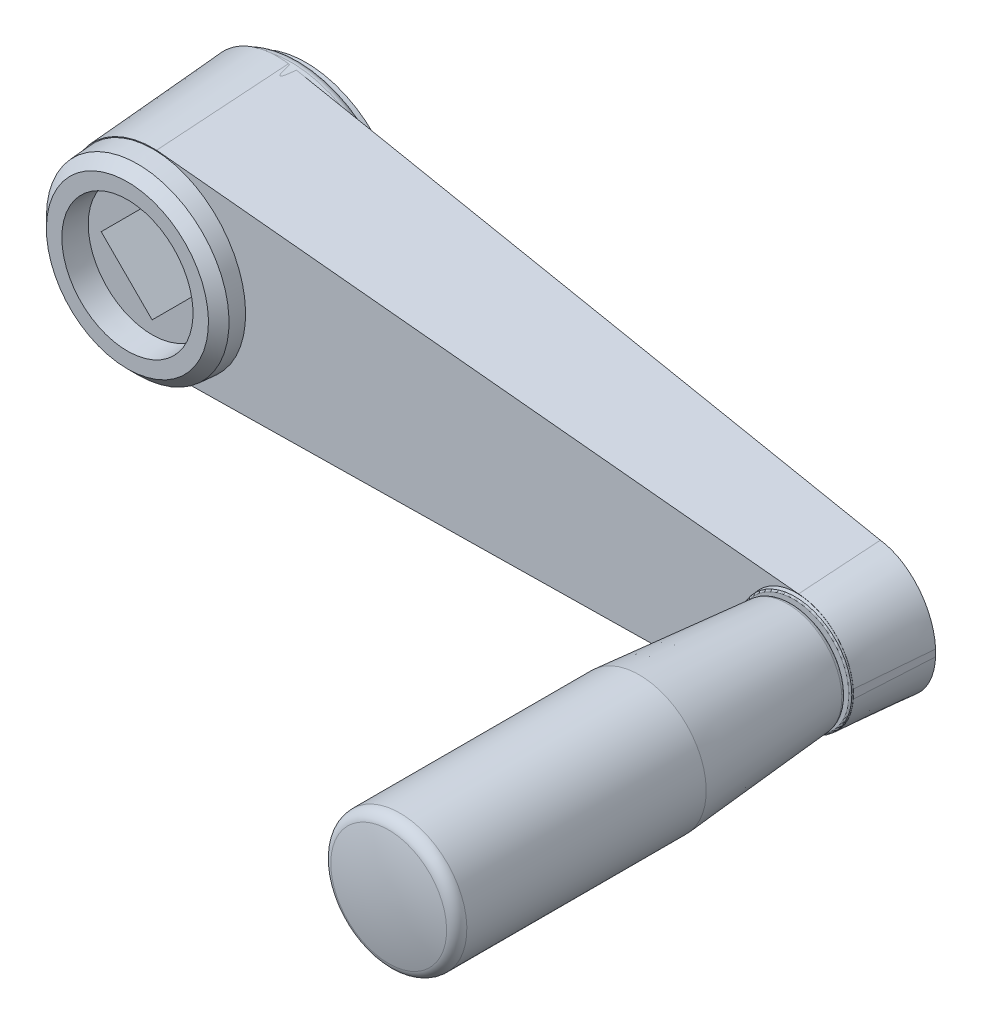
ISO-10303-21;
HEADER;
FILE_DESCRIPTION(('STEP AP214'),'2;1');
FILE_NAME('part.step','',(''),(''),'','','');
FILE_SCHEMA(('AUTOMOTIVE_DESIGN { 1 0 10303 214 1 1 1 1 }'));
ENDSEC;
DATA;
#1=APPLICATION_CONTEXT('core data for automotive mechanical design processes');
#2=APPLICATION_PROTOCOL_DEFINITION('international standard','automotive_design',2000,#1);
#3=PRODUCT_CONTEXT('',#1,'mechanical');
#4=PRODUCT('Part','Part','',(#3));
#5=PRODUCT_RELATED_PRODUCT_CATEGORY('part','',(#4));
#6=PRODUCT_DEFINITION_FORMATION('','',#4);
#7=PRODUCT_DEFINITION_CONTEXT('part definition',#1,'design');
#8=PRODUCT_DEFINITION('design','',#6,#7);
#9=PRODUCT_DEFINITION_SHAPE('','',#8);
#10=(LENGTH_UNIT() NAMED_UNIT(*) SI_UNIT(.MILLI.,.METRE.));
#11=(NAMED_UNIT(*) PLANE_ANGLE_UNIT() SI_UNIT($,.RADIAN.));
#12=(NAMED_UNIT(*) SI_UNIT($,.STERADIAN.) SOLID_ANGLE_UNIT());
#13=UNCERTAINTY_MEASURE_WITH_UNIT(LENGTH_MEASURE(1.E-05),#10,'distance_accuracy_value','');
#14=(GEOMETRIC_REPRESENTATION_CONTEXT(3) GLOBAL_UNCERTAINTY_ASSIGNED_CONTEXT((#13)) GLOBAL_UNIT_ASSIGNED_CONTEXT((#10,
#11,#12)) REPRESENTATION_CONTEXT('',''));
#15=CARTESIAN_POINT('',(0.,0.,0.));
#16=DIRECTION('',(0.,0.,1.));
#17=DIRECTION('',(1.,0.,0.));
#18=AXIS2_PLACEMENT_3D('',#15,#16,#17);
#19=CARTESIAN_POINT('',(0.,0.,35.));
#20=DIRECTION('',(0.,0.,1.));
#21=DIRECTION('',(0.,-1.,0.));
#22=AXIS2_PLACEMENT_3D('',#19,#20,#21);
#23=PLANE('',#22);
#24=CARTESIAN_POINT('',(0.,0.,35.));
#25=DIRECTION('',(0.,0.,1.));
#26=DIRECTION('',(0.,-1.,0.));
#27=AXIS2_PLACEMENT_3D('',#24,#25,#26);
#28=CIRCLE('',#27,15.7499999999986);
#29=CARTESIAN_POINT('',(0.,-15.7499999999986,35.));
#30=VERTEX_POINT('',#29);
#31=EDGE_CURVE('E173',#30,#30,#28,.T.);
#32=ORIENTED_EDGE('',*,*,#31,.T.);
#33=EDGE_LOOP('',(#32));
#34=FACE_BOUND('',#33,.T.);
#35=CARTESIAN_POINT('',(0.,0.,35.));
#36=DIRECTION('',(0.,0.,1.));
#37=DIRECTION('',(-1.,0.,0.));
#38=AXIS2_PLACEMENT_3D('',#35,#36,#37);
#39=CIRCLE('',#38,12.75);
#40=CARTESIAN_POINT('',(-12.75,0.,35.));
#41=VERTEX_POINT('',#40);
#42=EDGE_CURVE('E727',#41,#41,#39,.T.);
#43=ORIENTED_EDGE('',*,*,#42,.F.);
#44=EDGE_LOOP('',(#43));
#45=FACE_BOUND('',#44,.T.);
#46=ADVANCED_FACE('F14',(#34,#45),#23,.T.);
#47=CARTESIAN_POINT('',(-13.75,0.,0.));
#48=DIRECTION('',(0.,0.,-1.));
#49=DIRECTION('',(0.,1.,0.));
#50=AXIS2_PLACEMENT_3D('',#47,#48,#49);
#51=PLANE('',#50);
#52=CARTESIAN_POINT('',(0.,0.,0.));
#53=DIRECTION('',(0.,0.,1.));
#54=DIRECTION('',(0.,-1.,0.));
#55=AXIS2_PLACEMENT_3D('',#52,#53,#54);
#56=CIRCLE('',#55,13.75);
#57=CARTESIAN_POINT('',(0.,-13.75,0.));
#58=VERTEX_POINT('',#57);
#59=EDGE_CURVE('E155',#58,#58,#56,.T.);
#60=ORIENTED_EDGE('',*,*,#59,.F.);
#61=EDGE_LOOP('',(#60));
#62=FACE_BOUND('',#61,.T.);
#63=DIRECTION('',(-0.707106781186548,-0.707106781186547,0.));
#64=VECTOR('',#63,1.);
#65=CARTESIAN_POINT('',(9.8994949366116,0.,0.));
#66=LINE('',#65,#64);
#67=CARTESIAN_POINT('',(9.8994949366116,0.,0.));
#68=VERTEX_POINT('',#67);
#69=CARTESIAN_POINT('',(0.,-9.89949493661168,0.));
#70=VERTEX_POINT('',#69);
#71=EDGE_CURVE('E718',#68,#70,#66,.T.);
#72=ORIENTED_EDGE('',*,*,#71,.F.);
#73=DIRECTION('',(0.707106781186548,-0.707106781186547,0.));
#74=VECTOR('',#73,1.);
#75=CARTESIAN_POINT('',(0.,9.89949493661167,0.));
#76=LINE('',#75,#74);
#77=CARTESIAN_POINT('',(0.,9.89949493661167,0.));
#78=VERTEX_POINT('',#77);
#79=EDGE_CURVE('E138',#78,#68,#76,.T.);
#80=ORIENTED_EDGE('',*,*,#79,.F.);
#81=DIRECTION('',(-0.707106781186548,-0.707106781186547,0.));
#82=VECTOR('',#81,1.);
#83=CARTESIAN_POINT('',(0.,9.89949493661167,0.));
#84=LINE('',#83,#82);
#85=CARTESIAN_POINT('',(-9.89949493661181,0.,0.));
#86=VERTEX_POINT('',#85);
#87=EDGE_CURVE('E143',#78,#86,#84,.T.);
#88=ORIENTED_EDGE('',*,*,#87,.T.);
#89=DIRECTION('',(0.707106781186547,-0.707106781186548,0.));
#90=VECTOR('',#89,1.);
#91=CARTESIAN_POINT('',(-9.89949493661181,0.,0.));
#92=LINE('',#91,#90);
#93=EDGE_CURVE('E36',#86,#70,#92,.T.);
#94=ORIENTED_EDGE('',*,*,#93,.T.);
#95=EDGE_LOOP('',(#72,#80,#88,#94));
#96=FACE_BOUND('',#95,.T.);
#97=ADVANCED_FACE('F285',(#62,#96),#51,.T.);
#98=CARTESIAN_POINT('',(-20.1321366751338,-20.,1.38482810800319));
#99=DIRECTION('',(-0.114070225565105,0.,0.993472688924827));
#100=DIRECTION('',(-0.993472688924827,0.,-0.114070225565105));
#101=AXIS2_PLACEMENT_3D('',#98,#99,#100);
#102=PLANE('',#101);
#103=DIRECTION('',(0.991730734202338,0.0591922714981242,0.113870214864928));
#104=VECTOR('',#103,1.);
#105=CARTESIAN_POINT('',(-20.0633459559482,-21.1677415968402,1.39272663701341));
#106=LINE('',#105,#104);
#107=CARTESIAN_POINT('',(129.969630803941,-12.2128989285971,18.6194664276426));
#108=VERTEX_POINT('',#107);
#109=CARTESIAN_POINT('',(1.75271123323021,-19.8656321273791,3.89763954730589));
#110=VERTEX_POINT('',#109);
#111=EDGE_CURVE('E354',#108,#110,#106,.F.);
#112=ORIENTED_EDGE('',*,*,#111,.T.);
#113=CARTESIAN_POINT('',(-0.172677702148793,0.,3.67656698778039));
#114=DIRECTION('',(-0.114070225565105,0.,0.993472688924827));
#115=DIRECTION('',(-0.993472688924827,0.,-0.114070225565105));
#116=AXIS2_PLACEMENT_3D('',#113,#114,#115);
#117=ELLIPSE('',#116,20.0905965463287,19.9587120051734);
#118=CARTESIAN_POINT('',(1.75271123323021,19.8656321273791,3.89763954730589));
#119=VERTEX_POINT('',#118);
#120=EDGE_CURVE('E261',#110,#119,#117,.T.);
#121=ORIENTED_EDGE('',*,*,#120,.T.);
#122=DIRECTION('',(-0.991730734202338,0.0591922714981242,-0.113870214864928));
#123=VECTOR('',#122,1.);
#124=CARTESIAN_POINT('',(-17.7152341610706,21.0275925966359,1.6623361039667));
#125=LINE('',#124,#123);
#126=CARTESIAN_POINT('',(129.969630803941,12.2128989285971,18.6194664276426));
#127=VERTEX_POINT('',#126);
#128=EDGE_CURVE('E365',#119,#127,#125,.F.);
#129=ORIENTED_EDGE('',*,*,#128,.T.);
#130=CARTESIAN_POINT('',(129.901938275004,0.,18.6116939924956));
#131=DIRECTION('',(-0.114070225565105,0.,0.993472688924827));
#132=DIRECTION('',(-0.993472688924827,0.,-0.114070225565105));
#133=AXIS2_PLACEMENT_3D('',#130,#131,#132);
#134=ELLIPSE('',#133,12.2937251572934,12.2130865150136);
#135=CARTESIAN_POINT('',(142.097777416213,0.656184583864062,20.0120164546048));
#136=VERTEX_POINT('',#135);
#137=EDGE_CURVE('E234',#127,#136,#134,.F.);
#138=ORIENTED_EDGE('',*,*,#137,.T.);
#139=DIRECTION('',(0.,1.,0.));
#140=VECTOR('',#139,1.);
#141=CARTESIAN_POINT('',(142.097777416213,-20.,20.0120164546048));
#142=LINE('',#141,#140);
#143=CARTESIAN_POINT('',(142.097777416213,-0.656184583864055,20.0120164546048));
#144=VERTEX_POINT('',#143);
#145=EDGE_CURVE('E373',#144,#136,#142,.T.);
#146=ORIENTED_EDGE('',*,*,#145,.F.);
#147=EDGE_CURVE('E393',#144,#108,#134,.F.);
#148=ORIENTED_EDGE('',*,*,#147,.T.);
#149=EDGE_LOOP('',(#112,#121,#129,#138,#146,#148));
#150=FACE_BOUND('',#149,.T.);
#151=ADVANCED_FACE('F200',(#150),#102,.F.);
#152=CARTESIAN_POINT('',(0.,0.,1.38482810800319));
#153=DIRECTION('',(0.,0.,-1.));
#154=DIRECTION('',(0.,1.,0.));
#155=AXIS2_PLACEMENT_3D('',#152,#153,#154);
#156=CONICAL_SURFACE('',#155,20.1321,0.0698131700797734);
#157=CARTESIAN_POINT('',(-0.051062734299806,0.,29.2844621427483));
#158=DIRECTION('',(-0.0401317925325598,0.,0.999194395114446));
#159=DIRECTION('',(-0.999194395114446,0.,-0.0401317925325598));
#160=AXIS2_PLACEMENT_3D('',#157,#158,#159);
#161=ELLIPSE('',#160,18.1958261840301,18.1810958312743);
#162=CARTESIAN_POINT('',(-0.0490638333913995,18.1810957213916,29.2845424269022));
#163=VERTEX_POINT('',#162);
#164=CARTESIAN_POINT('',(-18.0845323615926,2.31274383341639,28.5601631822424));
#165=VERTEX_POINT('',#164);
#166=EDGE_CURVE('E381',#163,#165,#161,.T.);
#167=ORIENTED_EDGE('',*,*,#166,.F.);
#168=CARTESIAN_POINT('',(-0.0586959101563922,17.7848123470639,34.9512203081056));
#169=CARTESIAN_POINT('',(-0.0492354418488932,18.1760435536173,29.3568222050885));
#170=CARTESIAN_POINT('',(-0.0396138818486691,18.5672664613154,23.7624238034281));
#171=CARTESIAN_POINT('',(-0.0200485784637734,19.3496956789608,12.5736264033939));
#172=CARTESIAN_POINT('',(-0.0101048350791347,19.7409019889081,6.97922740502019));
#173=CARTESIAN_POINT('',(-1.80411241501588E-12,20.1321,1.38482810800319));
#174=B_SPLINE_CURVE_WITH_KNOTS('',3,(#168,#169,#170,#171,#172,#173),.UNSPECIFIED.,.F.,.F.,(4,2,
4),(0.,16.8242079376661,33.6484158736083),.UNSPECIFIED.);
#175=CARTESIAN_POINT('',(-0.0041620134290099,19.9704925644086,3.6959159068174));
#176=VERTEX_POINT('',#175);
#177=EDGE_CURVE('E417',#163,#176,#174,.T.);
#178=ORIENTED_EDGE('',*,*,#177,.T.);
#179=CARTESIAN_POINT('',(-0.160352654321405,0.,3.6779821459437));
#180=DIRECTION('',(-0.114070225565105,0.,0.993472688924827));
#181=DIRECTION('',(-0.993472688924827,0.,-0.114070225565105));
#182=AXIS2_PLACEMENT_3D('',#179,#180,#181);
#183=ELLIPSE('',#182,20.1029653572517,19.9711033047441);
#184=CARTESIAN_POINT('',(-0.0041620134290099,-19.9704925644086,3.6959159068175));
#185=VERTEX_POINT('',#184);
#186=EDGE_CURVE('E360',#176,#185,#183,.T.);
#187=ORIENTED_EDGE('',*,*,#186,.T.);
#188=CARTESIAN_POINT('',(-0.0586959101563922,-17.7848123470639,34.9512203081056));
#189=CARTESIAN_POINT('',(-0.0492354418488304,-18.1760435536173,29.3568222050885));
#190=CARTESIAN_POINT('',(-0.039613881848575,-18.5672664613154,23.7624238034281));
#191=CARTESIAN_POINT('',(-0.0200485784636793,-19.3496956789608,12.5736264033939));
#192=CARTESIAN_POINT('',(-0.010104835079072,-19.7409019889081,6.97922740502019));
#193=CARTESIAN_POINT('',(-1.80411241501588E-12,-20.1321,1.38482810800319));
#194=B_SPLINE_CURVE_WITH_KNOTS('',3,(#188,#189,#190,#191,#192,#193),.UNSPECIFIED.,.F.,.F.,(4,2,
4),(0.,16.8242079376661,33.6484158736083),.UNSPECIFIED.);
#195=CARTESIAN_POINT('',(-0.0490638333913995,-18.1810957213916,29.2845424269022));
#196=VERTEX_POINT('',#195);
#197=EDGE_CURVE('E233',#196,#185,#194,.T.);
#198=ORIENTED_EDGE('',*,*,#197,.F.);
#199=CARTESIAN_POINT('',(-18.0845323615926,-2.31274383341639,28.5601631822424));
#200=VERTEX_POINT('',#199);
#201=EDGE_CURVE('E379',#200,#196,#161,.T.);
#202=ORIENTED_EDGE('',*,*,#201,.F.);
#203=CARTESIAN_POINT('',(-9.6901966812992,0.,139.967862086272));
#204=DIRECTION('',(0.997173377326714,0.,-0.0751349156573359));
#205=DIRECTION('',(-0.0751349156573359,0.,-0.997173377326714));
#206=AXIS2_PLACEMENT_3D('',#203,#204,#205);
#207=ELLIPSE('',#206,138.969081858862,3.88890136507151);
#208=EDGE_CURVE('E382',#200,#165,#207,.T.);
#209=ORIENTED_EDGE('',*,*,#208,.T.);
#210=EDGE_LOOP('',(#167,#178,#187,#198,#202,#209));
#211=FACE_BOUND('',#210,.T.);
#212=ADVANCED_FACE('F240',(#211),#156,.T.);
#213=CARTESIAN_POINT('',(0.,-20.1321,1.38482810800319));
#214=DIRECTION('',(0.0514517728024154,-0.996236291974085,0.0697564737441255));
#215=DIRECTION('',(0.,-0.069848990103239,-0.997557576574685));
#216=AXIS2_PLACEMENT_3D('',#213,#214,#215);
#217=PLANE('',#216);
#218=CARTESIAN_POINT('',(0.278755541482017,-19.9536063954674,3.72840041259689));
#219=VERTEX_POINT('',#218);
#220=EDGE_CURVE('E359',#219,#185,#106,.F.);
#221=ORIENTED_EDGE('',*,*,#220,.F.);
#222=CARTESIAN_POINT('',(0.274141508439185,-19.956133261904,3.6957159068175));
#223=CARTESIAN_POINT('',(0.299503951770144,-19.9423317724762,3.87411658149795));
#224=CARTESIAN_POINT('',(0.325702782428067,-19.9284865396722,4.05252507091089));
#225=CARTESIAN_POINT('',(0.381918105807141,-19.900515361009,4.41053521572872));
#226=CARTESIAN_POINT('',(0.411969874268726,-19.8863879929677,4.59013116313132));
#227=CARTESIAN_POINT('',(0.481981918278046,-19.8560344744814,4.97198866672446));
#228=CARTESIAN_POINT('',(0.522728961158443,-19.8397795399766,5.17408099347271));
#229=CARTESIAN_POINT('',(0.615193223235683,-19.8069006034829,5.57544502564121));
#230=CARTESIAN_POINT('',(0.666841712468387,-19.7902794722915,5.77472642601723));
#231=CARTESIAN_POINT('',(0.757077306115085,-19.7690260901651,6.01170241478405));
#232=CARTESIAN_POINT('',(0.775616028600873,-19.7649116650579,6.05678911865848));
#233=CARTESIAN_POINT('',(0.817121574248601,-19.7566213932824,6.14457359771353));
#234=CARTESIAN_POINT('',(0.840037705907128,-19.7524467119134,6.18729212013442));
#235=CARTESIAN_POINT('',(0.876120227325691,-19.7469879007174,6.2386386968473));
#236=CARTESIAN_POINT('',(0.884928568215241,-19.7457198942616,6.25025094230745));
#237=CARTESIAN_POINT('',(0.903791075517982,-19.7431929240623,6.27242737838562));
#238=CARTESIAN_POINT('',(0.913842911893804,-19.7419339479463,6.28299346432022));
#239=CARTESIAN_POINT('',(0.931240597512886,-19.7399545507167,6.29843010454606));
#240=CARTESIAN_POINT('',(0.938058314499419,-19.7392203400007,6.30388714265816));
#241=CARTESIAN_POINT('',(0.952382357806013,-19.7377842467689,6.3138316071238));
#242=CARTESIAN_POINT('',(0.959887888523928,-19.7370823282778,6.3183201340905));
#243=CARTESIAN_POINT('',(0.973750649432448,-19.735898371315,6.32500391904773));
#244=CARTESIAN_POINT('',(0.97996417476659,-19.7354033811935,6.32749014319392));
#245=CARTESIAN_POINT('',(0.992717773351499,-19.7344703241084,6.33140877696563));
#246=CARTESIAN_POINT('',(0.999257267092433,-19.7340321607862,6.33284299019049));
#247=CARTESIAN_POINT('',(1.01254548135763,-19.7332304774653,6.33449106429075));
#248=CARTESIAN_POINT('',(1.01929535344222,-19.7328675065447,6.33469623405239));
#249=CARTESIAN_POINT('',(1.03271874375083,-19.7322346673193,6.33383323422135));
#250=CARTESIAN_POINT('',(1.03939220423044,-19.7319648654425,6.33276415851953));
#251=CARTESIAN_POINT('',(1.05330660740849,-19.7314901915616,6.32928013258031));
#252=CARTESIAN_POINT('',(1.06050751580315,-19.7312984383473,6.32670735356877));
#253=CARTESIAN_POINT('',(1.07440250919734,-19.7310196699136,6.32043979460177));
#254=CARTESIAN_POINT('',(1.08109555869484,-19.7309328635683,6.3167427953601));
#255=CARTESIAN_POINT('',(1.09828338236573,-19.7308125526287,6.30578344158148));
#256=CARTESIAN_POINT('',(1.10830866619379,-19.7308541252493,6.29779515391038));
#257=CARTESIAN_POINT('',(1.12713548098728,-19.7310926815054,6.28050168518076));
#258=CARTESIAN_POINT('',(1.13593318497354,-19.7312901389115,6.27119256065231));
#259=CARTESIAN_POINT('',(1.169741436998,-19.7322911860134,6.23195929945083));
#260=CARTESIAN_POINT('',(1.19099956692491,-19.733507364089,6.19891047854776));
#261=CARTESIAN_POINT('',(1.22948847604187,-19.7363053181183,6.13056204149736));
#262=CARTESIAN_POINT('',(1.24668724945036,-19.7378898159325,6.09524715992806));
#263=CARTESIAN_POINT('',(1.29897311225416,-19.743395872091,5.9780460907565));
#264=CARTESIAN_POINT('',(1.32905558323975,-19.7477309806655,5.89394509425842));
#265=CARTESIAN_POINT('',(1.38381233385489,-19.7568031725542,5.72399128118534));
#266=CARTESIAN_POINT('',(1.408470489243,-19.7615413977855,5.63813404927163));
#267=CARTESIAN_POINT('',(1.47745177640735,-19.7761038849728,5.37927796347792));
#268=CARTESIAN_POINT('',(1.51679496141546,-19.7862779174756,5.2049569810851));
#269=CARTESIAN_POINT('',(1.59906133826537,-19.8098372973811,4.80781161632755));
#270=CARTESIAN_POINT('',(1.64006948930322,-19.8233462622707,4.58463429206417));
#271=CARTESIAN_POINT('',(1.71545669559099,-19.8506156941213,4.13957734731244));
#272=CARTESIAN_POINT('',(1.74990079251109,-19.8643720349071,3.91770868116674));
#273=CARTESIAN_POINT('',(1.78314853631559,-19.8781988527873,3.6957159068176));
#274=B_SPLINE_CURVE_WITH_KNOTS('',3,(#222,#223,#224,#225,#226,#227,#228,#229,#230,#231,#232,
#233,#234,#235,#236,#237,#238,#239,#240,#241,#242,#243,#244,#245,#246,#247,#248,#249,#250,#251,
#252,#253,#254,#255,#256,#257,#258,#259,#260,#261,#262,#263,#264,#265,#266,#267,#268,#269,#270,
#271,#272,#273),.UNSPECIFIED.,.F.,.F.,(4,2,2,2,2,2,2,2,2,2,2,2,2,2,2,2,2,2,2,2,2,2,2,2,2,4),(0.,
0.542405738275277,1.09018929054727,1.71097792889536,2.32796375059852,2.47469576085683,
2.61982163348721,2.66365918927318,2.70741581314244,2.73365148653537,2.75985718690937,
2.77991488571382,2.79993811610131,2.82010277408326,2.84028177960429,2.86310169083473,
2.88596694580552,2.92420546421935,2.96256064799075,3.07957561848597,3.19748447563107,
3.46505928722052,3.73341905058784,4.27001877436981,4.95191054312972,5.6266474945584),.UNSPECIFIED.);
#275=EDGE_CURVE('E253',#219,#110,#274,.T.);
#276=ORIENTED_EDGE('',*,*,#275,.T.);
#277=ORIENTED_EDGE('',*,*,#111,.F.);
#278=CARTESIAN_POINT('',(129.942336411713,-11.0707590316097,34.9512203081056));
#279=CARTESIAN_POINT('',(129.95354216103,-11.5520939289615,28.0687071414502));
#280=CARTESIAN_POINT('',(129.96512787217,-12.0334092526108,21.186193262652));
#281=CARTESIAN_POINT('',(129.984580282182,-12.815844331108,9.99739542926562));
#282=CARTESIAN_POINT('',(129.992215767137,-13.1169759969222,5.69111190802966));
#283=CARTESIAN_POINT('',(130.,-13.4181,1.38482810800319));
#284=B_SPLINE_CURVE_WITH_KNOTS('',3,(#278,#279,#280,#281,#282,#283),.UNSPECIFIED.,.F.,.F.,(4,2,
4),(0.,20.6979990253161,33.6484178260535),.UNSPECIFIED.);
#285=CARTESIAN_POINT('',(129.943060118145,-11.1019264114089,34.5055654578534));
#286=VERTEX_POINT('',#285);
#287=EDGE_CURVE('E226',#286,#108,#284,.T.);
#288=ORIENTED_EDGE('',*,*,#287,.F.);
#289=DIRECTION('',(0.99771839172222,0.054334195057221,0.0400725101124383));
#290=VECTOR('',#289,1.);
#291=CARTESIAN_POINT('',(-18.1298911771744,-19.1657495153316,28.5583413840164));
#292=LINE('',#291,#290);
#293=EDGE_CURVE('E385',#286,#196,#292,.F.);
#294=ORIENTED_EDGE('',*,*,#293,.T.);
#295=ORIENTED_EDGE('',*,*,#197,.T.);
#296=EDGE_LOOP('',(#221,#276,#277,#288,#294,#295));
#297=FACE_BOUND('',#296,.T.);
#298=ADVANCED_FACE('F236',(#297),#217,.T.);
#299=CARTESIAN_POINT('',(130.,13.4181,1.38482810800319));
#300=DIRECTION('',(0.0514517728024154,0.996236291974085,0.0697564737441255));
#301=DIRECTION('',(0.,-0.069848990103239,0.997557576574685));
#302=AXIS2_PLACEMENT_3D('',#299,#300,#301);
#303=PLANE('',#302);
#304=ORIENTED_EDGE('',*,*,#128,.F.);
#305=CARTESIAN_POINT('',(1.78314853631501,19.8781988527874,3.69571590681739));
#306=CARTESIAN_POINT('',(1.75649923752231,19.8670835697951,3.87411658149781));
#307=CARTESIAN_POINT('',(1.72901349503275,19.8560109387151,4.05252507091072));
#308=CARTESIAN_POINT('',(1.6702157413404,19.8339797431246,4.41053521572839));
#309=CARTESIAN_POINT('',(1.63886849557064,19.8230233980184,4.59013116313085));
#310=CARTESIAN_POINT('',(1.56610200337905,19.8000438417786,4.97198866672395));
#311=CARTESIAN_POINT('',(1.52389721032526,19.7880730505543,5.17408099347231));
#312=CARTESIAN_POINT('',(1.42853779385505,19.7648944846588,5.57544502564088));
#313=CARTESIAN_POINT('',(1.37545183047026,19.7536824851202,5.77472642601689));
#314=CARTESIAN_POINT('',(1.28350686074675,19.7418380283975,6.01170241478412));
#315=CARTESIAN_POINT('',(1.26464291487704,19.7396553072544,6.05678911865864));
#316=CARTESIAN_POINT('',(1.22250415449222,19.7356849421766,6.14457359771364));
#317=CARTESIAN_POINT('',(1.19927988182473,19.733893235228,6.18729212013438));
#318=CARTESIAN_POINT('',(1.16282698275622,19.7321805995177,6.23863869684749));
#319=CARTESIAN_POINT('',(1.15393487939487,19.7318267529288,6.25025094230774));
#320=CARTESIAN_POINT('',(1.13491240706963,19.7312563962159,6.27242737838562));
#321=CARTESIAN_POINT('',(1.12478435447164,19.7310396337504,6.28299346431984));
#322=CARTESIAN_POINT('',(1.10727531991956,19.730863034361,6.29843010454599));
#323=CARTESIAN_POINT('',(1.10041823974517,19.730835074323,6.30388714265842));
#324=CARTESIAN_POINT('',(1.08602246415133,19.7308822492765,6.31383160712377));
#325=CARTESIAN_POINT('',(1.07848455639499,19.7309572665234,6.31832013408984));
#326=CARTESIAN_POINT('',(1.06457358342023,19.7312077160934,6.3250039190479));
#327=CARTESIAN_POINT('',(1.05834212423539,19.731355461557,6.3274901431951));
#328=CARTESIAN_POINT('',(1.04556025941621,19.7317412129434,6.33140877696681));
#329=CARTESIAN_POINT('',(1.03901042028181,19.7319790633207,6.33284299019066));
#330=CARTESIAN_POINT('',(1.02571031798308,19.7325505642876,6.33449106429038));
#331=CARTESIAN_POINT('',(1.01895896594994,19.7328848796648,6.33469623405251));
#332=CARTESIAN_POINT('',(1.00554180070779,19.7336382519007,6.33383323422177));
#333=CARTESIAN_POINT('',(0.998876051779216,19.7340573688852,6.33276415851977));
#334=CARTESIAN_POINT('',(0.984986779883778,19.7350186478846,6.32928013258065));
#335=CARTESIAN_POINT('',(0.977804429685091,19.7355697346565,6.32670735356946));
#336=CARTESIAN_POINT('',(0.963954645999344,19.7367238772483,6.32043979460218));
#337=CARTESIAN_POINT('',(0.957288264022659,19.7373270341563,6.31674279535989));
#338=CARTESIAN_POINT('',(0.940179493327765,19.7389780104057,6.30578344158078));
#339=CARTESIAN_POINT('',(0.930211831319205,19.7400521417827,6.29779515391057));
#340=CARTESIAN_POINT('',(0.91150975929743,19.742228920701,6.28050168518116));
#341=CARTESIAN_POINT('',(0.902779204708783,19.7433316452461,6.27119256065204));
#342=CARTESIAN_POINT('',(0.869253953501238,19.7478102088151,6.23195929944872));
#343=CARTESIAN_POINT('',(0.848234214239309,19.751209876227,6.1989104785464));
#344=CARTESIAN_POINT('',(0.810238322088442,19.7579579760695,6.13056204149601));
#345=CARTESIAN_POINT('',(0.793294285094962,19.7613058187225,6.09524715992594));
#346=CARTESIAN_POINT('',(0.741853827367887,19.7721689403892,5.97804609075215));
#347=CARTESIAN_POINT('',(0.712378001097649,19.7795800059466,5.8939450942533));
#348=CARTESIAN_POINT('',(0.658847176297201,19.794244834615,5.72399128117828));
#349=CARTESIAN_POINT('',(0.634808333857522,19.8014980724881,5.63813404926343));
#350=CARTESIAN_POINT('',(0.567694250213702,19.8230893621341,5.37927796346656));
#351=CARTESIAN_POINT('',(0.529608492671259,19.8372623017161,5.20495698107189));
#352=CARTESIAN_POINT('',(0.450206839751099,19.8691712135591,4.80781161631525));
#353=CARTESIAN_POINT('',(0.410808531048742,19.8868328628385,4.58463429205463));
#354=CARTESIAN_POINT('',(0.338631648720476,19.9217234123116,4.13957734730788));
#355=CARTESIAN_POINT('',(0.305787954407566,19.9389549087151,3.91770868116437));
#356=CARTESIAN_POINT('',(0.274141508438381,19.956133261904,3.6957159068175));
#357=B_SPLINE_CURVE_WITH_KNOTS('',3,(#305,#306,#307,#308,#309,#310,#311,#312,#313,#314,#315,
#316,#317,#318,#319,#320,#321,#322,#323,#324,#325,#326,#327,#328,#329,#330,#331,#332,#333,#334,
#335,#336,#337,#338,#339,#340,#341,#342,#343,#344,#345,#346,#347,#348,#349,#350,#351,#352,#353,
#354,#355,#356),.UNSPECIFIED.,.F.,.F.,(4,2,2,2,2,2,2,2,2,2,2,2,2,2,2,2,2,2,2,2,2,2,2,2,2,4),(0.,
0.542405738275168,1.09018929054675,1.71097792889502,2.32796375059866,2.47469576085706,
2.61982163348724,2.66365918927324,2.70741581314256,2.73365148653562,2.75985718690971,
2.77991488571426,2.7999381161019,2.82010277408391,2.84028177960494,2.86310169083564,
2.88596694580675,2.92420546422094,2.96256064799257,3.07957561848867,3.19748447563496,
3.46505928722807,3.73341905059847,4.27001877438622,4.95191054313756,5.62664749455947),.UNSPECIFIED.);
#358=CARTESIAN_POINT('',(0.278755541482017,19.9536063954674,3.72840041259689));
#359=VERTEX_POINT('',#358);
#360=EDGE_CURVE('E262',#119,#359,#357,.T.);
#361=ORIENTED_EDGE('',*,*,#360,.T.);
#362=EDGE_CURVE('E363',#176,#359,#125,.F.);
#363=ORIENTED_EDGE('',*,*,#362,.F.);
#364=ORIENTED_EDGE('',*,*,#177,.F.);
#365=DIRECTION('',(-0.99771839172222,0.054334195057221,-0.0400725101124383));
#366=VECTOR('',#365,1.);
#367=CARTESIAN_POINT('',(-15.9614821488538,19.047661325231,28.6454336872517));
#368=LINE('',#367,#366);
#369=CARTESIAN_POINT('',(129.943060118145,11.1019264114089,34.5055654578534));
#370=VERTEX_POINT('',#369);
#371=EDGE_CURVE('E388',#163,#370,#368,.F.);
#372=ORIENTED_EDGE('',*,*,#371,.T.);
#373=CARTESIAN_POINT('',(129.942336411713,11.0707590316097,34.9512203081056));
#374=CARTESIAN_POINT('',(129.95354216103,11.5520939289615,28.0687071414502));
#375=CARTESIAN_POINT('',(129.96512787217,12.0334092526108,21.186193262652));
#376=CARTESIAN_POINT('',(129.984580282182,12.815844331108,9.99739542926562));
#377=CARTESIAN_POINT('',(129.992215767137,13.1169759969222,5.69111190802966));
#378=CARTESIAN_POINT('',(130.,13.4181,1.38482810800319));
#379=B_SPLINE_CURVE_WITH_KNOTS('',3,(#373,#374,#375,#376,#377,#378),.UNSPECIFIED.,.F.,.F.,(4,2,
4),(0.,20.6979990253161,33.6484178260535),.UNSPECIFIED.);
#380=EDGE_CURVE('E219',#370,#127,#379,.T.);
#381=ORIENTED_EDGE('',*,*,#380,.T.);
#382=EDGE_LOOP('',(#304,#361,#363,#364,#372,#381));
#383=FACE_BOUND('',#382,.T.);
#384=ADVANCED_FACE('F213',(#383),#303,.T.);
#385=CARTESIAN_POINT('',(130.,0.,1.38482810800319));
#386=DIRECTION('',(0.,0.,-1.));
#387=DIRECTION('',(0.,-1.,0.));
#388=AXIS2_PLACEMENT_3D('',#385,#386,#387);
#389=CONICAL_SURFACE('',#388,13.4181,0.0698131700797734);
#390=CARTESIAN_POINT('',(136.665144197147,0.,96.6582770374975));
#391=DIRECTION('',(0.997497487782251,0.,0.0707019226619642));
#392=DIRECTION('',(0.0707019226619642,0.,-0.997497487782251));
#393=AXIS2_PLACEMENT_3D('',#390,#391,#392);
#394=ELLIPSE('',#393,95.5551305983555,1.10383995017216);
#395=CARTESIAN_POINT('',(141.038897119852,-0.841297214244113,34.9512203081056));
#396=VERTEX_POINT('',#395);
#397=EDGE_CURVE('E369',#144,#396,#394,.F.);
#398=ORIENTED_EDGE('',*,*,#397,.T.);
#399=CARTESIAN_POINT('',(129.968819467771,0.,34.5066000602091));
#400=DIRECTION('',(-0.0401317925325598,0.,0.999194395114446));
#401=DIRECTION('',(-0.999194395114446,0.,-0.0401317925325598));
#402=AXIS2_PLACEMENT_3D('',#399,#400,#401);
#403=ELLIPSE('',#402,11.110951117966,11.1019562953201);
#404=EDGE_CURVE('E390',#396,#286,#403,.F.);
#405=ORIENTED_EDGE('',*,*,#404,.T.);
#406=ORIENTED_EDGE('',*,*,#287,.T.);
#407=ORIENTED_EDGE('',*,*,#147,.F.);
#408=EDGE_LOOP('',(#398,#405,#406,#407));
#409=FACE_BOUND('',#408,.T.);
#410=ADVANCED_FACE('F209',(#409),#389,.T.);
#411=ORIENTED_EDGE('',*,*,#380,.F.);
#412=CARTESIAN_POINT('',(141.038897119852,0.841297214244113,34.9512203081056));
#413=VERTEX_POINT('',#412);
#414=EDGE_CURVE('E391',#370,#413,#403,.F.);
#415=ORIENTED_EDGE('',*,*,#414,.T.);
#416=EDGE_CURVE('E366',#413,#136,#394,.F.);
#417=ORIENTED_EDGE('',*,*,#416,.T.);
#418=ORIENTED_EDGE('',*,*,#137,.F.);
#419=EDGE_LOOP('',(#411,#415,#417,#418));
#420=FACE_BOUND('',#419,.T.);
#421=ADVANCED_FACE('F198',(#420),#389,.T.);
#422=CARTESIAN_POINT('',(-18.3288946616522,0.,1.59187579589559));
#423=CARTESIAN_POINT('',(-18.3314479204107,-0.0265989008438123,1.59158263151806));
#424=CARTESIAN_POINT('',(-18.333944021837,-0.0532040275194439,1.59129602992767));
#425=CARTESIAN_POINT('',(-18.3821774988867,-0.579479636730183,1.58575787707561));
#426=CARTESIAN_POINT('',(-18.4078121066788,-1.08123629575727,1.58281451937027));
#427=CARTESIAN_POINT('',(-18.4184458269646,-2.08568099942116,1.58159355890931));
#428=CARTESIAN_POINT('',(-18.4033955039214,-2.58836943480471,1.58332163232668));
#429=CARTESIAN_POINT('',(-18.3321200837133,-3.59724014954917,1.59150545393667));
#430=CARTESIAN_POINT('',(-18.2753742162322,-4.10338565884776,1.59802099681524));
#431=CARTESIAN_POINT('',(-18.120371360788,-5.10938130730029,1.61581837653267));
#432=CARTESIAN_POINT('',(-18.0220988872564,-5.60922902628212,1.62710199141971));
#433=CARTESIAN_POINT('',(-17.7844864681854,-6.59952830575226,1.65438457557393));
#434=CARTESIAN_POINT('',(-17.6451011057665,-7.089968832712,1.67038875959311));
#435=CARTESIAN_POINT('',(-17.3261714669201,-8.0574366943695,1.70700816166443));
#436=CARTESIAN_POINT('',(-17.146627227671,-8.53446404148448,1.72762337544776));
#437=CARTESIAN_POINT('',(-16.7459466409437,-9.47781621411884,1.77362939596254));
#438=CARTESIAN_POINT('',(-16.5243013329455,-9.94392216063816,1.79907864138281));
#439=CARTESIAN_POINT('',(-16.0424652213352,-10.8555129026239,1.85440291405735));
#440=CARTESIAN_POINT('',(-15.7822730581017,-11.3009969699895,1.88427809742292));
#441=CARTESIAN_POINT('',(-15.2252149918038,-12.1678892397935,1.94823933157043));
#442=CARTESIAN_POINT('',(-14.9283615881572,-12.5893055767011,1.98232394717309));
#443=CARTESIAN_POINT('',(-14.2999853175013,-13.4050523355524,2.05447391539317));
#444=CARTESIAN_POINT('',(-13.9684630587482,-13.7993832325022,2.09253919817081));
#445=CARTESIAN_POINT('',(-13.2766639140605,-14.5540326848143,2.17197136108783));
#446=CARTESIAN_POINT('',(-12.9167267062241,-14.9146657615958,2.21329923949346));
#447=CARTESIAN_POINT('',(-12.3550506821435,-15.4313953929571,2.27779070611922));
#448=CARTESIAN_POINT('',(-12.1641879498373,-15.599608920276,2.29970550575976));
#449=CARTESIAN_POINT('',(-11.7754506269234,-15.9277295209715,2.34434020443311));
#450=CARTESIAN_POINT('',(-11.5775741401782,-16.0876343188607,2.36706032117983));
#451=CARTESIAN_POINT('',(-10.9741053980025,-16.5542655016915,2.43635041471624));
#452=CARTESIAN_POINT('',(-10.5585229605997,-16.848047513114,2.48406746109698));
#453=CARTESIAN_POINT('',(-9.70381834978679,-17.3985817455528,2.58220437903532));
#454=CARTESIAN_POINT('',(-9.26469668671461,-17.6553347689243,2.63262419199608));
#455=CARTESIAN_POINT('',(-8.59415347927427,-18.009322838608,2.70961575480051));
#456=CARTESIAN_POINT('',(-8.3703686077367,-18.1214078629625,2.7353106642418));
#457=CARTESIAN_POINT('',(-7.91830871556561,-18.3358293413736,2.78721604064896));
#458=CARTESIAN_POINT('',(-7.69003488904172,-18.43816834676,2.81342637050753));
#459=CARTESIAN_POINT('',(-6.99896911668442,-18.7302796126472,2.89277432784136));
#460=CARTESIAN_POINT('',(-6.52986850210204,-18.9051801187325,2.94663631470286));
#461=CARTESIAN_POINT('',(-5.57777015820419,-19.2138014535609,3.05595595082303));
#462=CARTESIAN_POINT('',(-5.09475303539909,-19.3474614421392,3.11141582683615));
#463=CARTESIAN_POINT('',(-4.11888351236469,-19.5719430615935,3.22346486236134));
#464=CARTESIAN_POINT('',(-3.62602889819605,-19.6627549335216,3.28005427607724));
#465=CARTESIAN_POINT('',(-3.13006777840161,-19.7314565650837,3.3370003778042));
#466=B_SPLINE_CURVE_WITH_KNOTS('',3,(#422,#423,#424,#425,#426,#427,#428,#429,#430,#431,#432,
#433,#434,#435,#436,#437,#438,#439,#440,#441,#442,#443,#444,#445,#446,#447,#448,#449,#450,#451,
#452,#453,#454,#455,#456,#457,#458,#459,#460,#461,#462,#463,#464,#465),.UNSPECIFIED.,.F.,.F.,(4,
2,2,2,2,2,2,2,2,2,2,2,2,2,2,2,2,2,2,2,2,4),(0.,0.0801702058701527,1.58549200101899,
3.09264370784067,4.61894651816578,6.14581900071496,7.6743845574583,9.20294869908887,
10.7513264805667,12.2997588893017,13.8476648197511,15.3955435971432,16.9271174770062,
17.692972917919,18.4590370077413,19.9905499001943,21.5220296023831,22.2766312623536,
23.0310348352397,24.5396231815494,26.0504265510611,27.5615738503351),.UNSPECIFIED.);
#467=CARTESIAN_POINT('',(-18.4141672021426,-1.78001299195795,1.5820848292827));
#468=VERTEX_POINT('',#467);
#469=CARTESIAN_POINT('',(-4.3686460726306,-19.5126972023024,3.19478720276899));
#470=VERTEX_POINT('',#469);
#471=EDGE_CURVE('E183',#468,#470,#466,.T.);
#472=ORIENTED_EDGE('',*,*,#471,.T.);
#473=EDGE_CURVE('E260',#470,#219,#117,.T.);
#474=ORIENTED_EDGE('',*,*,#473,.T.);
#475=ORIENTED_EDGE('',*,*,#220,.T.);
#476=ORIENTED_EDGE('',*,*,#186,.F.);
#477=ORIENTED_EDGE('',*,*,#362,.T.);
#478=CARTESIAN_POINT('',(-4.3686460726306,19.5126972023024,3.19478720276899));
#479=VERTEX_POINT('',#478);
#480=EDGE_CURVE('E335',#359,#479,#117,.T.);
#481=ORIENTED_EDGE('',*,*,#480,.T.);
#482=CARTESIAN_POINT('',(-18.3288946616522,0.,1.59187579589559));
#483=CARTESIAN_POINT('',(-18.3314479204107,0.0265989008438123,1.59158263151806));
#484=CARTESIAN_POINT('',(-18.333944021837,0.0532040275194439,1.59129602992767));
#485=CARTESIAN_POINT('',(-18.3821774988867,0.579479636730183,1.58575787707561));
#486=CARTESIAN_POINT('',(-18.4078121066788,1.08123629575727,1.58281451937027));
#487=CARTESIAN_POINT('',(-18.4184458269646,2.08568099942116,1.58159355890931));
#488=CARTESIAN_POINT('',(-18.4033955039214,2.58836943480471,1.58332163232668));
#489=CARTESIAN_POINT('',(-18.3321200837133,3.59724014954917,1.59150545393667));
#490=CARTESIAN_POINT('',(-18.2753742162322,4.10338565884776,1.59802099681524));
#491=CARTESIAN_POINT('',(-18.120371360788,5.10938130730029,1.61581837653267));
#492=CARTESIAN_POINT('',(-18.0220988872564,5.60922902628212,1.62710199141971));
#493=CARTESIAN_POINT('',(-17.7844864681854,6.59952830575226,1.65438457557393));
#494=CARTESIAN_POINT('',(-17.6451011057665,7.089968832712,1.67038875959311));
#495=CARTESIAN_POINT('',(-17.3261714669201,8.0574366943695,1.70700816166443));
#496=CARTESIAN_POINT('',(-17.146627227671,8.53446404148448,1.72762337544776));
#497=CARTESIAN_POINT('',(-16.7459466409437,9.47781621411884,1.77362939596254));
#498=CARTESIAN_POINT('',(-16.5243013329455,9.94392216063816,1.79907864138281));
#499=CARTESIAN_POINT('',(-16.0424652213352,10.8555129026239,1.85440291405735));
#500=CARTESIAN_POINT('',(-15.7822730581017,11.3009969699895,1.88427809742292));
#501=CARTESIAN_POINT('',(-15.2252149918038,12.1678892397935,1.94823933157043));
#502=CARTESIAN_POINT('',(-14.9283615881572,12.5893055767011,1.98232394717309));
#503=CARTESIAN_POINT('',(-14.2999853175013,13.4050523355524,2.05447391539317));
#504=CARTESIAN_POINT('',(-13.9684630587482,13.7993832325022,2.09253919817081));
#505=CARTESIAN_POINT('',(-13.2766639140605,14.5540326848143,2.17197136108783));
#506=CARTESIAN_POINT('',(-12.9167267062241,14.9146657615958,2.21329923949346));
#507=CARTESIAN_POINT('',(-12.3550506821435,15.4313953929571,2.27779070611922));
#508=CARTESIAN_POINT('',(-12.1641879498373,15.599608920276,2.29970550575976));
#509=CARTESIAN_POINT('',(-11.7754506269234,15.9277295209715,2.34434020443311));
#510=CARTESIAN_POINT('',(-11.5775741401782,16.0876343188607,2.36706032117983));
#511=CARTESIAN_POINT('',(-10.9741053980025,16.5542655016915,2.43635041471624));
#512=CARTESIAN_POINT('',(-10.5585229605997,16.848047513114,2.48406746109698));
#513=CARTESIAN_POINT('',(-9.70381834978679,17.3985817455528,2.58220437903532));
#514=CARTESIAN_POINT('',(-9.26469668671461,17.6553347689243,2.63262419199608));
#515=CARTESIAN_POINT('',(-8.59415347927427,18.009322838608,2.70961575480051));
#516=CARTESIAN_POINT('',(-8.3703686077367,18.1214078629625,2.7353106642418));
#517=CARTESIAN_POINT('',(-7.91830871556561,18.3358293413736,2.78721604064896));
#518=CARTESIAN_POINT('',(-7.69003488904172,18.43816834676,2.81342637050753));
#519=CARTESIAN_POINT('',(-6.99896911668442,18.7302796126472,2.89277432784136));
#520=CARTESIAN_POINT('',(-6.52986850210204,18.9051801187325,2.94663631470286));
#521=CARTESIAN_POINT('',(-5.57777015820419,19.2138014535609,3.05595595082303));
#522=CARTESIAN_POINT('',(-5.09475303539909,19.3474614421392,3.11141582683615));
#523=CARTESIAN_POINT('',(-4.11888351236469,19.5719430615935,3.22346486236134));
#524=CARTESIAN_POINT('',(-3.62602889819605,19.6627549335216,3.28005427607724));
#525=CARTESIAN_POINT('',(-3.13006777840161,19.7314565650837,3.3370003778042));
#526=B_SPLINE_CURVE_WITH_KNOTS('',3,(#482,#483,#484,#485,#486,#487,#488,#489,#490,#491,#492,
#493,#494,#495,#496,#497,#498,#499,#500,#501,#502,#503,#504,#505,#506,#507,#508,#509,#510,#511,
#512,#513,#514,#515,#516,#517,#518,#519,#520,#521,#522,#523,#524,#525),.UNSPECIFIED.,.F.,.F.,(4,
2,2,2,2,2,2,2,2,2,2,2,2,2,2,2,2,2,2,2,2,4),(0.,0.0801702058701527,1.58549200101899,
3.09264370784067,4.61894651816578,6.14581900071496,7.6743845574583,9.20294869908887,
10.7513264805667,12.2997588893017,13.8476648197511,15.3955435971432,16.9271174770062,
17.692972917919,18.4590370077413,19.9905499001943,21.5220296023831,22.2766312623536,
23.0310348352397,24.5396231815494,26.0504265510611,27.5615738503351),.UNSPECIFIED.);
#527=CARTESIAN_POINT('',(-18.4141672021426,1.78001299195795,1.5820848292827));
#528=VERTEX_POINT('',#527);
#529=EDGE_CURVE('E176',#479,#528,#526,.F.);
#530=ORIENTED_EDGE('',*,*,#529,.T.);
#531=CARTESIAN_POINT('',(0.,0.,3.6963937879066));
#532=DIRECTION('',(-0.114070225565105,0.,0.993472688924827));
#533=DIRECTION('',(0.993472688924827,0.,0.114070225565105));
#534=AXIS2_PLACEMENT_3D('',#531,#532,#533);
#535=ELLIPSE('',#534,18.6215486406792,18.5);
#536=EDGE_CURVE('E22',#468,#528,#535,.F.);
#537=ORIENTED_EDGE('',*,*,#536,.F.);
#538=EDGE_LOOP('',(#472,#474,#475,#476,#477,#481,#530,#537));
#539=FACE_BOUND('',#538,.T.);
#540=ADVANCED_FACE('F193',(#539),#102,.F.);
#541=CARTESIAN_POINT('',(141.038897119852,-20.,34.9512203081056));
#542=DIRECTION('',(0.997497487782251,0.,0.0707019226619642));
#543=DIRECTION('',(-0.0707019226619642,0.,0.997497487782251));
#544=AXIS2_PLACEMENT_3D('',#541,#542,#543);
#545=PLANE('',#544);
#546=ORIENTED_EDGE('',*,*,#397,.F.);
#547=ORIENTED_EDGE('',*,*,#145,.T.);
#548=ORIENTED_EDGE('',*,*,#416,.F.);
#549=DIRECTION('',(0.,1.,0.));
#550=VECTOR('',#549,1.);
#551=CARTESIAN_POINT('',(141.038897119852,-20.,34.9512203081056));
#552=LINE('',#551,#550);
#553=CARTESIAN_POINT('',(141.038897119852,0.,34.9512203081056));
#554=VERTEX_POINT('',#553);
#555=EDGE_CURVE('E378',#554,#413,#552,.T.);
#556=ORIENTED_EDGE('',*,*,#555,.F.);
#557=EDGE_CURVE('E375',#396,#554,#552,.T.);
#558=ORIENTED_EDGE('',*,*,#557,.F.);
#559=EDGE_LOOP('',(#546,#547,#548,#556,#558));
#560=FACE_BOUND('',#559,.T.);
#561=ADVANCED_FACE('F197',(#560),#545,.T.);
#562=CARTESIAN_POINT('',(-18.0845323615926,-20.,28.5601631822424));
#563=DIRECTION('',(-0.0401317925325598,0.,0.999194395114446));
#564=DIRECTION('',(-0.999194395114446,0.,-0.0401317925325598));
#565=AXIS2_PLACEMENT_3D('',#562,#563,#564);
#566=PLANE('',#565);
#567=DIRECTION('',(0.,1.,0.));
#568=VECTOR('',#567,1.);
#569=CARTESIAN_POINT('',(-18.0845323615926,-20.,28.5601631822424));
#570=LINE('',#569,#568);
#571=CARTESIAN_POINT('',(-18.0845323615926,0.,28.5601631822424));
#572=VERTEX_POINT('',#571);
#573=EDGE_CURVE('E372',#572,#165,#570,.T.);
#574=ORIENTED_EDGE('',*,*,#573,.F.);
#575=CARTESIAN_POINT('',(-0.0545638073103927,0.,29.2843215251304));
#576=DIRECTION('',(-0.0401317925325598,0.,0.999194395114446));
#577=DIRECTION('',(-0.999194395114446,0.,-0.0401317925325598));
#578=AXIS2_PLACEMENT_3D('',#575,#576,#577);
#579=ELLIPSE('',#578,18.0445052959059,18.0298859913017);
#580=EDGE_CURVE('E338',#572,#572,#579,.T.);
#581=ORIENTED_EDGE('',*,*,#580,.F.);
#582=EDGE_CURVE('E370',#200,#572,#570,.T.);
#583=ORIENTED_EDGE('',*,*,#582,.F.);
#584=ORIENTED_EDGE('',*,*,#201,.T.);
#585=ORIENTED_EDGE('',*,*,#293,.F.);
#586=ORIENTED_EDGE('',*,*,#404,.F.);
#587=ORIENTED_EDGE('',*,*,#557,.T.);
#588=CARTESIAN_POINT('',(129.96848467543,0.,34.5065866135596));
#589=DIRECTION('',(-0.0401317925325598,0.,0.999194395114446));
#590=DIRECTION('',(-0.999194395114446,0.,-0.0401317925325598));
#591=AXIS2_PLACEMENT_3D('',#588,#589,#590);
#592=ELLIPSE('',#591,11.0793380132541,11.0703675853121);
#593=EDGE_CURVE('E353',#554,#554,#592,.T.);
#594=ORIENTED_EDGE('',*,*,#593,.F.);
#595=ORIENTED_EDGE('',*,*,#555,.T.);
#596=ORIENTED_EDGE('',*,*,#414,.F.);
#597=ORIENTED_EDGE('',*,*,#371,.F.);
#598=ORIENTED_EDGE('',*,*,#166,.T.);
#599=EDGE_LOOP('',(#574,#581,#583,#584,#585,#586,#587,#594,#595,#596,#597,#598));
#600=FACE_BOUND('',#599,.T.);
#601=ADVANCED_FACE('F204',(#600),#566,.T.);
#602=CARTESIAN_POINT('',(-18.0845323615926,-20.,28.5601631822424));
#603=DIRECTION('',(0.997173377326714,0.,-0.0751349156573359));
#604=DIRECTION('',(0.0751349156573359,0.,0.997173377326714));
#605=AXIS2_PLACEMENT_3D('',#602,#603,#604);
#606=PLANE('',#605);
#607=ORIENTED_EDGE('',*,*,#208,.F.);
#608=ORIENTED_EDGE('',*,*,#582,.T.);
#609=ORIENTED_EDGE('',*,*,#573,.T.);
#610=EDGE_LOOP('',(#607,#608,#609));
#611=FACE_BOUND('',#610,.T.);
#612=ADVANCED_FACE('F16',(#611),#606,.F.);
#613=CARTESIAN_POINT('',(130.,0.,65.5));
#614=DIRECTION('',(0.,-1.,0.));
#615=DIRECTION('',(1.,0.,0.));
#616=AXIS2_PLACEMENT_3D('',#613,#614,#615);
#617=SPHERICAL_SURFACE('',#616,50.);
#618=CARTESIAN_POINT('',(130.,0.,65.5));
#619=DIRECTION('',(0.,0.,1.));
#620=DIRECTION('',(0.,-1.,0.));
#621=AXIS2_PLACEMENT_3D('',#618,#619,#620);
#622=SPHERICAL_SURFACE('',#621,50.);
#623=CARTESIAN_POINT('',(130.,0.,114.216426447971));
#624=DIRECTION('',(0.,0.,1.));
#625=DIRECTION('',(0.,-1.,0.));
#626=AXIS2_PLACEMENT_3D('',#623,#624,#625);
#627=CIRCLE('',#626,11.2565445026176);
#628=CARTESIAN_POINT('',(130.,-11.2565445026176,114.216426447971));
#629=VERTEX_POINT('',#628);
#630=EDGE_CURVE('E268',#629,#629,#627,.T.);
#631=ORIENTED_EDGE('',*,*,#630,.T.);
#632=EDGE_LOOP('',(#631));
#633=FACE_BOUND('',#632,.T.);
#634=ADVANCED_FACE('F320',(#633),#622,.T.);
#635=CARTESIAN_POINT('',(130.,0.,35.2212105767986));
#636=DIRECTION('',(0.,0.,-1.));
#637=DIRECTION('',(0.,1.,0.));
#638=AXIS2_PLACEMENT_3D('',#635,#636,#637);
#639=CONICAL_SURFACE('',#638,11.0197603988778,0.0707609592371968);
#640=ORIENTED_EDGE('',*,*,#593,.T.);
#641=EDGE_LOOP('',(#640));
#642=FACE_BOUND('',#641,.T.);
#643=CARTESIAN_POINT('',(130.,0.,35.2212105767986));
#644=DIRECTION('',(0.,0.,1.));
#645=DIRECTION('',(0.,-1.,0.));
#646=AXIS2_PLACEMENT_3D('',#643,#644,#645);
#647=CIRCLE('',#646,11.0197603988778);
#648=CARTESIAN_POINT('',(130.,-11.0197603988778,35.2212105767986));
#649=VERTEX_POINT('',#648);
#650=EDGE_CURVE('E419',#649,#649,#647,.T.);
#651=ORIENTED_EDGE('',*,*,#650,.F.);
#652=EDGE_LOOP('',(#651));
#653=FACE_BOUND('',#652,.T.);
#654=ADVANCED_FACE('F317',(#642,#653),#639,.T.);
#655=CARTESIAN_POINT('',(130.,0.,35.2));
#656=DIRECTION('',(0.,0.,1.));
#657=DIRECTION('',(0.,-1.,0.));
#658=AXIS2_PLACEMENT_3D('',#655,#656,#657);
#659=TOROIDAL_SURFACE('',#658,10.7205111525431,0.299999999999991);
#660=ORIENTED_EDGE('',*,*,#650,.T.);
#661=EDGE_LOOP('',(#660));
#662=FACE_BOUND('',#661,.T.);
#663=CARTESIAN_POINT('',(130.,0.,35.5));
#664=DIRECTION('',(0.,0.,1.));
#665=DIRECTION('',(0.,-1.,0.));
#666=AXIS2_PLACEMENT_3D('',#663,#664,#665);
#667=CIRCLE('',#666,10.7205111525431);
#668=CARTESIAN_POINT('',(130.,-10.7205111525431,35.5));
#669=VERTEX_POINT('',#668);
#670=EDGE_CURVE('E421',#669,#669,#667,.T.);
#671=ORIENTED_EDGE('',*,*,#670,.F.);
#672=EDGE_LOOP('',(#671));
#673=FACE_BOUND('',#672,.T.);
#674=ADVANCED_FACE('F313',(#662,#673),#659,.T.);
#675=CARTESIAN_POINT('',(140.720511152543,0.,35.5));
#676=DIRECTION('',(0.,0.,-1.));
#677=DIRECTION('',(0.,1.,0.));
#678=AXIS2_PLACEMENT_3D('',#675,#676,#677);
#679=PLANE('',#678);
#680=CARTESIAN_POINT('',(130.,0.,35.5));
#681=DIRECTION('',(0.,0.,1.));
#682=DIRECTION('',(0.,-1.,0.));
#683=AXIS2_PLACEMENT_3D('',#680,#681,#682);
#684=CIRCLE('',#683,6.);
#685=CARTESIAN_POINT('',(130.,-6.,35.5));
#686=VERTEX_POINT('',#685);
#687=EDGE_CURVE('E428',#686,#686,#684,.T.);
#688=ORIENTED_EDGE('',*,*,#687,.F.);
#689=EDGE_LOOP('',(#688));
#690=FACE_BOUND('',#689,.T.);
#691=ORIENTED_EDGE('',*,*,#670,.T.);
#692=EDGE_LOOP('',(#691));
#693=FACE_BOUND('',#692,.T.);
#694=ADVANCED_FACE('F309',(#690,#693),#679,.F.);
#695=CARTESIAN_POINT('',(130.,0.,120.195199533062));
#696=DIRECTION('',(0.,0.,1.));
#697=DIRECTION('',(0.,-1.,0.));
#698=AXIS2_PLACEMENT_3D('',#695,#696,#697);
#699=CYLINDRICAL_SURFACE('',#698,6.);
#700=ORIENTED_EDGE('',*,*,#687,.T.);
#701=EDGE_LOOP('',(#700));
#702=FACE_BOUND('',#701,.T.);
#703=CARTESIAN_POINT('',(130.,0.,35.8));
#704=DIRECTION('',(0.,0.,1.));
#705=DIRECTION('',(0.,-1.,0.));
#706=AXIS2_PLACEMENT_3D('',#703,#704,#705);
#707=CIRCLE('',#706,6.);
#708=CARTESIAN_POINT('',(130.,-6.,35.8));
#709=VERTEX_POINT('',#708);
#710=EDGE_CURVE('E433',#709,#709,#707,.T.);
#711=ORIENTED_EDGE('',*,*,#710,.F.);
#712=EDGE_LOOP('',(#711));
#713=FACE_BOUND('',#712,.T.);
#714=ADVANCED_FACE('F305',(#702,#713),#699,.T.);
#715=CARTESIAN_POINT('',(139.580638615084,0.,35.8));
#716=DIRECTION('',(0.,0.,-1.));
#717=DIRECTION('',(0.,1.,0.));
#718=AXIS2_PLACEMENT_3D('',#715,#716,#717);
#719=PLANE('',#718);
#720=ORIENTED_EDGE('',*,*,#710,.T.);
#721=EDGE_LOOP('',(#720));
#722=FACE_BOUND('',#721,.T.);
#723=CARTESIAN_POINT('',(130.,0.,35.8));
#724=DIRECTION('',(0.,0.,1.));
#725=DIRECTION('',(0.,-1.,0.));
#726=AXIS2_PLACEMENT_3D('',#723,#724,#725);
#727=CIRCLE('',#726,9.58063861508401);
#728=CARTESIAN_POINT('',(130.,-9.58063861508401,35.8));
#729=VERTEX_POINT('',#728);
#730=EDGE_CURVE('E436',#729,#729,#727,.T.);
#731=ORIENTED_EDGE('',*,*,#730,.F.);
#732=EDGE_LOOP('',(#731));
#733=FACE_BOUND('',#732,.T.);
#734=ADVANCED_FACE('F301',(#722,#733),#719,.T.);
#735=CARTESIAN_POINT('',(130.,0.,36.8));
#736=DIRECTION('',(0.,0.,1.));
#737=DIRECTION('',(0.,-1.,0.));
#738=AXIS2_PLACEMENT_3D('',#735,#736,#737);
#739=TOROIDAL_SURFACE('',#738,9.58063861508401,0.999999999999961);
#740=ORIENTED_EDGE('',*,*,#730,.T.);
#741=EDGE_LOOP('',(#740));
#742=FACE_BOUND('',#741,.T.);
#743=CARTESIAN_POINT('',(130.,0.,36.7161215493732));
#744=DIRECTION('',(0.,0.,1.));
#745=DIRECTION('',(0.,-1.,0.));
#746=AXIS2_PLACEMENT_3D('',#743,#744,#745);
#747=CIRCLE('',#746,10.5771146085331);
#748=CARTESIAN_POINT('',(130.,-10.5771146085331,36.7161215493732));
#749=VERTEX_POINT('',#748);
#750=EDGE_CURVE('E439',#749,#749,#747,.T.);
#751=ORIENTED_EDGE('',*,*,#750,.F.);
#752=EDGE_LOOP('',(#751));
#753=FACE_BOUND('',#752,.T.);
#754=ADVANCED_FACE('F297',(#742,#753),#739,.T.);
#755=CARTESIAN_POINT('',(130.,0.,36.7161215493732));
#756=DIRECTION('',(0.,0.,1.));
#757=DIRECTION('',(0.,-1.,0.));
#758=AXIS2_PLACEMENT_3D('',#755,#756,#757);
#759=CONICAL_SURFACE('',#758,10.5771146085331,0.0839771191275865);
#760=CARTESIAN_POINT('',(130.,0.,65.5));
#761=DIRECTION('',(0.,0.,1.));
#762=DIRECTION('',(0.,-1.,0.));
#763=AXIS2_PLACEMENT_3D('',#760,#761,#762);
#764=CIRCLE('',#763,13.);
#765=CARTESIAN_POINT('',(130.,-13.,65.5));
#766=VERTEX_POINT('',#765);
#767=EDGE_CURVE('E334',#766,#766,#764,.T.);
#768=ORIENTED_EDGE('',*,*,#767,.F.);
#769=EDGE_LOOP('',(#768));
#770=FACE_BOUND('',#769,.T.);
#771=ORIENTED_EDGE('',*,*,#750,.T.);
#772=EDGE_LOOP('',(#771));
#773=FACE_BOUND('',#772,.T.);
#774=ADVANCED_FACE('F293',(#770,#773),#759,.T.);
#775=CARTESIAN_POINT('',(130.,0.,120.195199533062));
#776=DIRECTION('',(0.,0.,1.));
#777=DIRECTION('',(0.,-1.,0.));
#778=AXIS2_PLACEMENT_3D('',#775,#776,#777);
#779=CYLINDRICAL_SURFACE('',#778,12.9999999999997);
#780=ORIENTED_EDGE('',*,*,#767,.T.);
#781=EDGE_LOOP('',(#780));
#782=FACE_BOUND('',#781,.T.);
#783=CARTESIAN_POINT('',(130.,0.,112.024187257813));
#784=DIRECTION('',(0.,0.,1.));
#785=DIRECTION('',(0.,-1.,0.));
#786=AXIS2_PLACEMENT_3D('',#783,#784,#785);
#787=CIRCLE('',#786,12.9999999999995);
#788=CARTESIAN_POINT('',(130.,-12.9999999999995,112.024187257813));
#789=VERTEX_POINT('',#788);
#790=EDGE_CURVE('E332',#789,#789,#787,.T.);
#791=ORIENTED_EDGE('',*,*,#790,.F.);
#792=EDGE_LOOP('',(#791));
#793=FACE_BOUND('',#792,.T.);
#794=ADVANCED_FACE('F289',(#782,#793),#779,.T.);
#795=CARTESIAN_POINT('',(130.,0.,112.024187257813));
#796=DIRECTION('',(0.,0.,1.));
#797=DIRECTION('',(0.,-1.,0.));
#798=AXIS2_PLACEMENT_3D('',#795,#796,#797);
#799=TOROIDAL_SURFACE('',#798,10.75,2.24999999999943);
#800=ORIENTED_EDGE('',*,*,#790,.T.);
#801=EDGE_LOOP('',(#800));
#802=FACE_BOUND('',#801,.T.);
#803=ORIENTED_EDGE('',*,*,#630,.F.);
#804=EDGE_LOOP('',(#803));
#805=FACE_BOUND('',#804,.T.);
#806=ADVANCED_FACE('F281',(#802,#805),#799,.T.);
#807=CARTESIAN_POINT('',(0.,0.,32.9999999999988));
#808=DIRECTION('',(0.,0.,-1.));
#809=DIRECTION('',(0.,1.,0.));
#810=AXIS2_PLACEMENT_3D('',#807,#808,#809);
#811=CONICAL_SURFACE('',#810,17.75,0.785398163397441);
#812=ORIENTED_EDGE('',*,*,#31,.F.);
#813=EDGE_LOOP('',(#812));
#814=FACE_BOUND('',#813,.T.);
#815=CARTESIAN_POINT('',(0.,0.,32.9999999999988));
#816=DIRECTION('',(0.,0.,1.));
#817=DIRECTION('',(0.,-1.,0.));
#818=AXIS2_PLACEMENT_3D('',#815,#816,#817);
#819=CIRCLE('',#818,17.75);
#820=CARTESIAN_POINT('',(0.,-17.75,32.9999999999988));
#821=VERTEX_POINT('',#820);
#822=EDGE_CURVE('E170',#821,#821,#819,.T.);
#823=ORIENTED_EDGE('',*,*,#822,.T.);
#824=EDGE_LOOP('',(#823));
#825=FACE_BOUND('',#824,.T.);
#826=ADVANCED_FACE('F275',(#814,#825),#811,.T.);
#827=CARTESIAN_POINT('',(0.,0.,32.9999999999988));
#828=DIRECTION('',(0.,0.,-1.));
#829=DIRECTION('',(0.,1.,0.));
#830=AXIS2_PLACEMENT_3D('',#827,#828,#829);
#831=CONICAL_SURFACE('',#830,17.75,0.0752057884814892);
#832=ORIENTED_EDGE('',*,*,#580,.T.);
#833=EDGE_LOOP('',(#832));
#834=FACE_BOUND('',#833,.T.);
#835=ORIENTED_EDGE('',*,*,#822,.F.);
#836=EDGE_LOOP('',(#835));
#837=FACE_BOUND('',#836,.T.);
#838=ADVANCED_FACE('F270',(#834,#837),#831,.T.);
#839=CARTESIAN_POINT('',(0.,0.,36.));
#840=DIRECTION('',(0.,0.,1.));
#841=DIRECTION('',(0.,-1.,0.));
#842=AXIS2_PLACEMENT_3D('',#839,#840,#841);
#843=CYLINDRICAL_SURFACE('',#842,18.5);
#844=CARTESIAN_POINT('',(0.,0.,0.299999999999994));
#845=DIRECTION('',(0.,0.,1.));
#846=DIRECTION('',(0.,-1.,0.));
#847=AXIS2_PLACEMENT_3D('',#844,#845,#846);
#848=CIRCLE('',#847,18.5);
#849=CARTESIAN_POINT('',(0.,-18.5,0.299999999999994));
#850=VERTEX_POINT('',#849);
#851=EDGE_CURVE('E161',#850,#850,#848,.T.);
#852=ORIENTED_EDGE('',*,*,#851,.T.);
#853=EDGE_LOOP('',(#852));
#854=FACE_BOUND('',#853,.T.);
#855=CARTESIAN_POINT('',(0.,0.,1.5820848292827));
#856=DIRECTION('',(0.,0.,1.));
#857=DIRECTION('',(0.,-1.,0.));
#858=AXIS2_PLACEMENT_3D('',#855,#856,#857);
#859=CIRCLE('',#858,18.5);
#860=EDGE_CURVE('E164',#468,#528,#859,.T.);
#861=ORIENTED_EDGE('',*,*,#860,.F.);
#862=ORIENTED_EDGE('',*,*,#536,.T.);
#863=EDGE_LOOP('',(#861,#862));
#864=FACE_BOUND('',#863,.T.);
#865=ADVANCED_FACE('F274',(#854,#864),#843,.T.);
#866=ORIENTED_EDGE('',*,*,#473,.F.);
#867=CARTESIAN_POINT('',(0.,0.,3.19478720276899));
#868=DIRECTION('',(0.,0.,1.));
#869=DIRECTION('',(0.,-1.,0.));
#870=AXIS2_PLACEMENT_3D('',#867,#868,#869);
#871=CIRCLE('',#870,19.9957600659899);
#872=EDGE_CURVE('E167',#470,#479,#871,.T.);
#873=ORIENTED_EDGE('',*,*,#872,.T.);
#874=ORIENTED_EDGE('',*,*,#480,.F.);
#875=ORIENTED_EDGE('',*,*,#360,.F.);
#876=ORIENTED_EDGE('',*,*,#120,.F.);
#877=ORIENTED_EDGE('',*,*,#275,.F.);
#878=EDGE_LOOP('',(#866,#873,#874,#875,#876,#877));
#879=FACE_BOUND('',#878,.T.);
#880=ADVANCED_FACE('F277',(#879),#831,.T.);
#881=CARTESIAN_POINT('',(0.,0.,3.082084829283));
#882=DIRECTION('',(0.,0.,1.));
#883=DIRECTION('',(0.,-1.,0.));
#884=AXIS2_PLACEMENT_3D('',#881,#882,#883);
#885=TOROIDAL_SURFACE('',#884,18.5,1.50000000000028);
#886=ORIENTED_EDGE('',*,*,#471,.F.);
#887=ORIENTED_EDGE('',*,*,#860,.T.);
#888=ORIENTED_EDGE('',*,*,#529,.F.);
#889=ORIENTED_EDGE('',*,*,#872,.F.);
#890=EDGE_LOOP('',(#886,#887,#888,#889));
#891=FACE_BOUND('',#890,.T.);
#892=ADVANCED_FACE('F189',(#891),#885,.T.);
#893=CARTESIAN_POINT('',(-18.5,0.,0.299999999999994));
#894=DIRECTION('',(0.,0.,-1.));
#895=DIRECTION('',(0.,1.,0.));
#896=AXIS2_PLACEMENT_3D('',#893,#894,#895);
#897=PLANE('',#896);
#898=CARTESIAN_POINT('',(0.,0.,0.299999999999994));
#899=DIRECTION('',(0.,0.,1.));
#900=DIRECTION('',(0.,-1.,0.));
#901=AXIS2_PLACEMENT_3D('',#898,#899,#900);
#902=CIRCLE('',#901,13.75);
#903=CARTESIAN_POINT('',(0.,-13.75,0.299999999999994));
#904=VERTEX_POINT('',#903);
#905=EDGE_CURVE('E158',#904,#904,#902,.T.);
#906=ORIENTED_EDGE('',*,*,#905,.T.);
#907=EDGE_LOOP('',(#906));
#908=FACE_BOUND('',#907,.T.);
#909=ORIENTED_EDGE('',*,*,#851,.F.);
#910=EDGE_LOOP('',(#909));
#911=FACE_BOUND('',#910,.T.);
#912=ADVANCED_FACE('F592',(#908,#911),#897,.T.);
#913=CARTESIAN_POINT('',(0.,0.,36.));
#914=DIRECTION('',(0.,0.,1.));
#915=DIRECTION('',(0.,-1.,0.));
#916=AXIS2_PLACEMENT_3D('',#913,#914,#915);
#917=CYLINDRICAL_SURFACE('',#916,13.75);
#918=ORIENTED_EDGE('',*,*,#59,.T.);
#919=EDGE_LOOP('',(#918));
#920=FACE_BOUND('',#919,.T.);
#921=ORIENTED_EDGE('',*,*,#905,.F.);
#922=EDGE_LOOP('',(#921));
#923=FACE_BOUND('',#922,.T.);
#924=ADVANCED_FACE('F600',(#920,#923),#917,.T.);
#925=CARTESIAN_POINT('',(0.,9.89949493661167,0.));
#926=DIRECTION('',(-0.707106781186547,-0.707106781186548,0.));
#927=DIRECTION('',(0.707106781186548,-0.707106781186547,0.));
#928=AXIS2_PLACEMENT_3D('',#925,#926,#927);
#929=PLANE('',#928);
#930=DIRECTION('',(0.707106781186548,-0.707106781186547,0.));
#931=VECTOR('',#930,1.);
#932=CARTESIAN_POINT('',(0.,9.89949493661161,30.2));
#933=LINE('',#932,#931);
#934=CARTESIAN_POINT('',(0.,9.89949493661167,30.2));
#935=VERTEX_POINT('',#934);
#936=CARTESIAN_POINT('',(9.8994949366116,0.,30.2));
#937=VERTEX_POINT('',#936);
#938=EDGE_CURVE('E127',#935,#937,#933,.T.);
#939=ORIENTED_EDGE('',*,*,#938,.F.);
#940=DIRECTION('',(0.,0.,1.));
#941=VECTOR('',#940,1.);
#942=CARTESIAN_POINT('',(0.,9.89949493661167,0.));
#943=LINE('',#942,#941);
#944=EDGE_CURVE('E135',#78,#935,#943,.T.);
#945=ORIENTED_EDGE('',*,*,#944,.F.);
#946=ORIENTED_EDGE('',*,*,#79,.T.);
#947=DIRECTION('',(0.,0.,1.));
#948=VECTOR('',#947,1.);
#949=CARTESIAN_POINT('',(9.8994949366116,0.,0.));
#950=LINE('',#949,#948);
#951=EDGE_CURVE('E137',#68,#937,#950,.T.);
#952=ORIENTED_EDGE('',*,*,#951,.T.);
#953=EDGE_LOOP('',(#939,#945,#946,#952));
#954=FACE_BOUND('',#953,.T.);
#955=ADVANCED_FACE('F133',(#954),#929,.T.);
#956=CARTESIAN_POINT('',(9.8994949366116,0.,0.));
#957=DIRECTION('',(-0.707106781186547,0.707106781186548,0.));
#958=DIRECTION('',(-0.707106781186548,-0.707106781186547,0.));
#959=AXIS2_PLACEMENT_3D('',#956,#957,#958);
#960=PLANE('',#959);
#961=DIRECTION('',(-0.707106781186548,-0.707106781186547,0.));
#962=VECTOR('',#961,1.);
#963=CARTESIAN_POINT('',(9.8994949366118,0.,30.2));
#964=LINE('',#963,#962);
#965=CARTESIAN_POINT('',(0.,-9.89949493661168,30.2));
#966=VERTEX_POINT('',#965);
#967=EDGE_CURVE('E139',#937,#966,#964,.T.);
#968=ORIENTED_EDGE('',*,*,#967,.F.);
#969=ORIENTED_EDGE('',*,*,#951,.F.);
#970=ORIENTED_EDGE('',*,*,#71,.T.);
#971=DIRECTION('',(0.,0.,1.));
#972=VECTOR('',#971,1.);
#973=CARTESIAN_POINT('',(0.,-9.89949493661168,0.));
#974=LINE('',#973,#972);
#975=EDGE_CURVE('E147',#70,#966,#974,.T.);
#976=ORIENTED_EDGE('',*,*,#975,.T.);
#977=EDGE_LOOP('',(#968,#969,#970,#976));
#978=FACE_BOUND('',#977,.T.);
#979=ADVANCED_FACE('F619',(#978),#960,.T.);
#980=CARTESIAN_POINT('',(-9.89949493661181,0.,0.));
#981=DIRECTION('',(-0.707106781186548,-0.707106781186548,0.));
#982=DIRECTION('',(0.707106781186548,-0.707106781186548,0.));
#983=AXIS2_PLACEMENT_3D('',#980,#981,#982);
#984=PLANE('',#983);
#985=DIRECTION('',(0.,0.,1.));
#986=VECTOR('',#985,1.);
#987=CARTESIAN_POINT('',(-9.89949493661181,0.,0.));
#988=LINE('',#987,#986);
#989=CARTESIAN_POINT('',(-9.89949493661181,0.,30.2));
#990=VERTEX_POINT('',#989);
#991=EDGE_CURVE('E145',#86,#990,#988,.T.);
#992=ORIENTED_EDGE('',*,*,#991,.T.);
#993=DIRECTION('',(0.707106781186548,-0.707106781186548,0.));
#994=VECTOR('',#993,1.);
#995=CARTESIAN_POINT('',(-9.8994949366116,0.,30.2));
#996=LINE('',#995,#994);
#997=EDGE_CURVE('E29',#990,#966,#996,.T.);
#998=ORIENTED_EDGE('',*,*,#997,.T.);
#999=ORIENTED_EDGE('',*,*,#975,.F.);
#1000=ORIENTED_EDGE('',*,*,#93,.F.);
#1001=EDGE_LOOP('',(#992,#998,#999,#1000));
#1002=FACE_BOUND('',#1001,.T.);
#1003=ADVANCED_FACE('F628',(#1002),#984,.F.);
#1004=CARTESIAN_POINT('',(0.,9.89949493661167,0.));
#1005=DIRECTION('',(-0.707106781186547,0.707106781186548,0.));
#1006=DIRECTION('',(-0.707106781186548,-0.707106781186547,0.));
#1007=AXIS2_PLACEMENT_3D('',#1004,#1005,#1006);
#1008=PLANE('',#1007);
#1009=ORIENTED_EDGE('',*,*,#944,.T.);
#1010=DIRECTION('',(-0.707106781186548,-0.707106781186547,0.));
#1011=VECTOR('',#1010,1.);
#1012=CARTESIAN_POINT('',(0.,9.89949493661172,30.2));
#1013=LINE('',#1012,#1011);
#1014=EDGE_CURVE('E9',#935,#990,#1013,.T.);
#1015=ORIENTED_EDGE('',*,*,#1014,.T.);
#1016=ORIENTED_EDGE('',*,*,#991,.F.);
#1017=ORIENTED_EDGE('',*,*,#87,.F.);
#1018=EDGE_LOOP('',(#1009,#1015,#1016,#1017));
#1019=FACE_BOUND('',#1018,.T.);
#1020=ADVANCED_FACE('F141',(#1019),#1008,.F.);
#1021=CARTESIAN_POINT('',(-12.414351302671,0.,30.2));
#1022=DIRECTION('',(0.,0.,-1.));
#1023=DIRECTION('',(1.,0.,0.));
#1024=AXIS2_PLACEMENT_3D('',#1021,#1022,#1023);
#1025=PLANE('',#1024);
#1026=ORIENTED_EDGE('',*,*,#938,.T.);
#1027=ORIENTED_EDGE('',*,*,#967,.T.);
#1028=ORIENTED_EDGE('',*,*,#997,.F.);
#1029=ORIENTED_EDGE('',*,*,#1014,.F.);
#1030=EDGE_LOOP('',(#1026,#1027,#1028,#1029));
#1031=FACE_BOUND('',#1030,.T.);
#1032=CARTESIAN_POINT('',(0.,0.,30.2));
#1033=DIRECTION('',(0.,0.,1.));
#1034=DIRECTION('',(-1.,0.,0.));
#1035=AXIS2_PLACEMENT_3D('',#1032,#1033,#1034);
#1036=CIRCLE('',#1035,12.4143513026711);
#1037=CARTESIAN_POINT('',(-12.4143513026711,0.,30.2));
#1038=VERTEX_POINT('',#1037);
#1039=EDGE_CURVE('E724',#1038,#1038,#1036,.T.);
#1040=ORIENTED_EDGE('',*,*,#1039,.T.);
#1041=EDGE_LOOP('',(#1040));
#1042=FACE_BOUND('',#1041,.T.);
#1043=ADVANCED_FACE('F125',(#1031,#1042),#1025,.F.);
#1044=CARTESIAN_POINT('',(0.,0.,30.2));
#1045=DIRECTION('',(0.,0.,1.));
#1046=DIRECTION('',(-1.,0.,0.));
#1047=AXIS2_PLACEMENT_3D('',#1044,#1045,#1046);
#1048=CONICAL_SURFACE('',#1047,12.4143513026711,0.0698131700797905);
#1049=ORIENTED_EDGE('',*,*,#42,.T.);
#1050=EDGE_LOOP('',(#1049));
#1051=FACE_BOUND('',#1050,.T.);
#1052=ORIENTED_EDGE('',*,*,#1039,.F.);
#1053=EDGE_LOOP('',(#1052));
#1054=FACE_BOUND('',#1053,.T.);
#1055=ADVANCED_FACE('F654',(#1051,#1054),#1048,.F.);
#1056=CLOSED_SHELL('',(#46,#97,#151,#212,#298,#384,#410,#421,#540,#561,#601,#612,#634,#654,#674,
#694,#714,#734,#754,#774,#794,#806,#826,#838,#865,#880,#892,#912,#924,#955,#979,#1003,#1020,
#1043,#1055));
#1057=MANIFOLD_SOLID_BREP('B1',#1056);
#1058=ADVANCED_BREP_SHAPE_REPRESENTATION('',(#18,#1057),#14);
#1059=SHAPE_DEFINITION_REPRESENTATION(#9,#1058);
ENDSEC;
END-ISO-10303-21;
